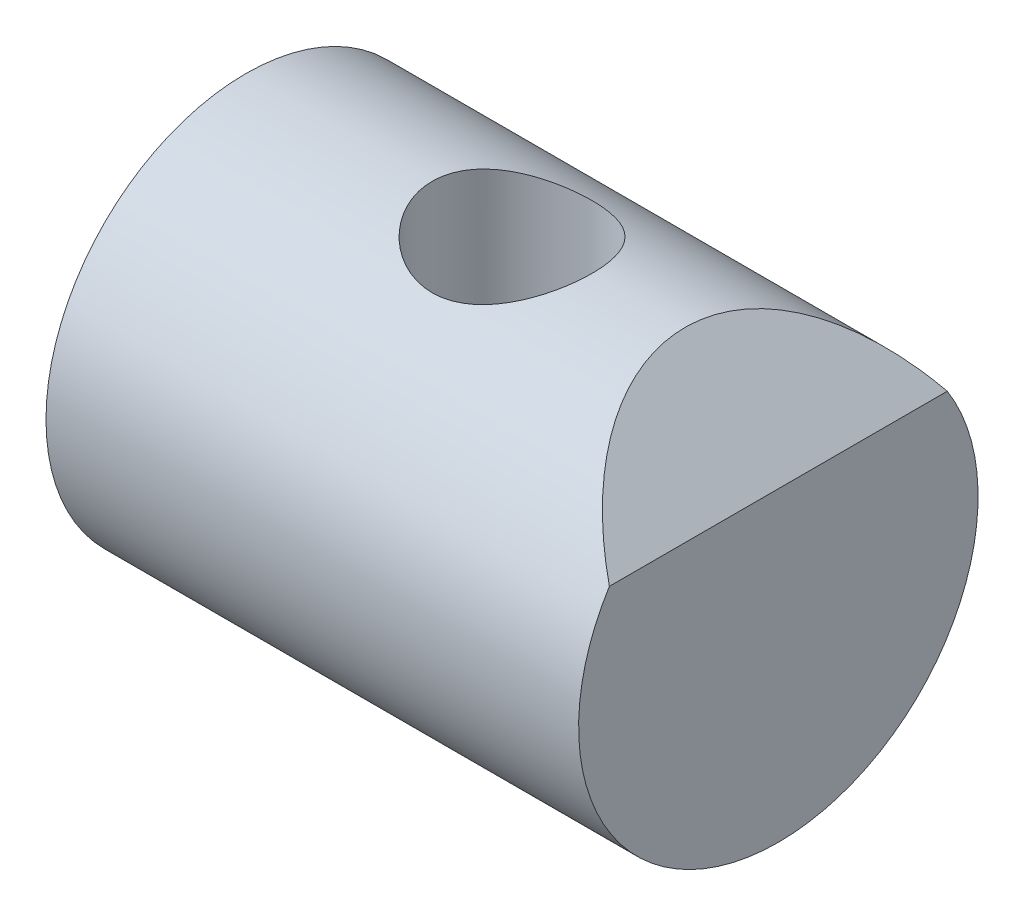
ISO-10303-21;
HEADER;
FILE_DESCRIPTION(('STEP AP214'),'2;1');
FILE_NAME('part.step','',(''),(''),'','','');
FILE_SCHEMA(('AUTOMOTIVE_DESIGN { 1 0 10303 214 1 1 1 1 }'));
ENDSEC;
DATA;
#1=APPLICATION_CONTEXT('core data for automotive mechanical design processes');
#2=APPLICATION_PROTOCOL_DEFINITION('international standard','automotive_design',2000,#1);
#3=PRODUCT_CONTEXT('',#1,'mechanical');
#4=PRODUCT('Part','Part','',(#3));
#5=PRODUCT_RELATED_PRODUCT_CATEGORY('part','',(#4));
#6=PRODUCT_DEFINITION_FORMATION('','',#4);
#7=PRODUCT_DEFINITION_CONTEXT('part definition',#1,'design');
#8=PRODUCT_DEFINITION('design','',#6,#7);
#9=PRODUCT_DEFINITION_SHAPE('','',#8);
#10=(LENGTH_UNIT() NAMED_UNIT(*) SI_UNIT(.MILLI.,.METRE.));
#11=(NAMED_UNIT(*) PLANE_ANGLE_UNIT() SI_UNIT($,.RADIAN.));
#12=(NAMED_UNIT(*) SI_UNIT($,.STERADIAN.) SOLID_ANGLE_UNIT());
#13=UNCERTAINTY_MEASURE_WITH_UNIT(LENGTH_MEASURE(1.E-05),#10,'distance_accuracy_value','');
#14=(GEOMETRIC_REPRESENTATION_CONTEXT(3) GLOBAL_UNCERTAINTY_ASSIGNED_CONTEXT((#13)) GLOBAL_UNIT_ASSIGNED_CONTEXT((#10,
#11,#12)) REPRESENTATION_CONTEXT('',''));
#15=CARTESIAN_POINT('',(0.,0.,0.));
#16=DIRECTION('',(0.,0.,1.));
#17=DIRECTION('',(1.,0.,0.));
#18=AXIS2_PLACEMENT_3D('',#15,#16,#17);
#19=CARTESIAN_POINT('',(0.,15.,15.));
#20=DIRECTION('',(0.,1.,0.));
#21=DIRECTION('',(0.,0.,1.));
#22=AXIS2_PLACEMENT_3D('',#19,#20,#21);
#23=CYLINDRICAL_SURFACE('',#22,5.99999999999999);
#24=CARTESIAN_POINT('',(0.,13.7477270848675,21.));
#25=CARTESIAN_POINT('',(-0.160765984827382,13.7477283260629,20.9999987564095));
#26=CARTESIAN_POINT('',(-0.321581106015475,13.7505565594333,20.9935297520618));
#27=CARTESIAN_POINT('',(-0.642048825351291,13.7617785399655,20.9677167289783));
#28=CARTESIAN_POINT('',(-0.80170065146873,13.7701756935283,20.9483648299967));
#29=CARTESIAN_POINT('',(-1.11890142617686,13.7922754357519,20.8969417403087));
#30=CARTESIAN_POINT('',(-1.27644553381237,13.8059885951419,20.864845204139));
#31=CARTESIAN_POINT('',(-1.58804060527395,13.8382744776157,20.7882539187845));
#32=CARTESIAN_POINT('',(-1.74209008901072,13.8568492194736,20.7437540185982));
#33=CARTESIAN_POINT('',(-2.04498326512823,13.8981849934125,20.6429959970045));
#34=CARTESIAN_POINT('',(-2.19384617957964,13.9209280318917,20.5867882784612));
#35=CARTESIAN_POINT('',(-2.48617450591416,13.969977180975,20.4629812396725));
#36=CARTESIAN_POINT('',(-2.62963783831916,13.9962846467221,20.3953775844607));
#37=CARTESIAN_POINT('',(-3.0504811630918,14.0794173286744,20.1763341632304));
#38=CARTESIAN_POINT('',(-3.3186931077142,14.1405074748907,20.0085349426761));
#39=CARTESIAN_POINT('',(-3.83785925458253,14.2710405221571,19.6239115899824));
#40=CARTESIAN_POINT('',(-4.08719705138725,14.340752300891,19.4049962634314));
#41=CARTESIAN_POINT('',(-4.43173906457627,14.4439708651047,19.0481020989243));
#42=CARTESIAN_POINT('',(-4.54173997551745,14.4781748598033,18.9242905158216));
#43=CARTESIAN_POINT('',(-4.75127893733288,14.5452673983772,18.6677974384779));
#44=CARTESIAN_POINT('',(-4.85082059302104,14.5781563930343,18.5351190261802));
#45=CARTESIAN_POINT('',(-5.04254160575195,14.6430448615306,18.2561569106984));
#46=CARTESIAN_POINT('',(-5.13426819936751,14.6749563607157,18.1095414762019));
#47=CARTESIAN_POINT('',(-5.3049385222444,14.7355355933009,17.8084787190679));
#48=CARTESIAN_POINT('',(-5.38388712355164,14.7642045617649,17.6540344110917));
#49=CARTESIAN_POINT('',(-5.52832744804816,14.8174861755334,17.3383170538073));
#50=CARTESIAN_POINT('',(-5.59382064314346,14.8420992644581,17.1770447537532));
#51=CARTESIAN_POINT('',(-5.71070630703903,14.8865456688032,16.8488303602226));
#52=CARTESIAN_POINT('',(-5.76209967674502,14.9063792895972,16.6818886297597));
#53=CARTESIAN_POINT('',(-5.84809570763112,14.9398371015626,16.3518276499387));
#54=CARTESIAN_POINT('',(-5.88339054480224,14.9537153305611,16.1889143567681));
#55=CARTESIAN_POINT('',(-5.94033370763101,14.9762104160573,15.8603647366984));
#56=CARTESIAN_POINT('',(-5.96198283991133,14.9848275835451,15.6947285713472));
#57=CARTESIAN_POINT('',(-5.99139107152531,14.9965524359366,15.3620836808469));
#58=CARTESIAN_POINT('',(-5.99915438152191,14.9996617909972,15.1950753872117));
#59=CARTESIAN_POINT('',(-6.00071466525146,15.0002858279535,14.8609858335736));
#60=CARTESIAN_POINT('',(-5.99451212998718,14.9978007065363,14.6939045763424));
#61=CARTESIAN_POINT('',(-5.96895714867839,14.9876056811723,14.3704186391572));
#62=CARTESIAN_POINT('',(-5.95036647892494,14.9801985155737,14.2139435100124));
#63=CARTESIAN_POINT('',(-5.90099471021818,14.9606558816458,13.9031762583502));
#64=CARTESIAN_POINT('',(-5.87020963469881,14.9485188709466,13.7488848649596));
#65=CARTESIAN_POINT('',(-5.79675476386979,14.9198265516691,13.4436355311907));
#66=CARTESIAN_POINT('',(-5.75408884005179,14.9032726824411,13.2926765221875));
#67=CARTESIAN_POINT('',(-5.6572347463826,14.8661462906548,12.9949530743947));
#68=CARTESIAN_POINT('',(-5.60304219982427,14.8455722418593,12.848190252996));
#69=CARTESIAN_POINT('',(-5.4827122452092,14.8005733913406,12.5576772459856));
#70=CARTESIAN_POINT('',(-5.41641137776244,14.7760965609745,12.4140027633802));
#71=CARTESIAN_POINT('',(-5.27292884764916,14.7241067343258,12.13274081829));
#72=CARTESIAN_POINT('',(-5.19574320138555,14.696592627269,11.9951556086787));
#73=CARTESIAN_POINT('',(-4.94868837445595,14.6104618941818,11.5927339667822));
#74=CARTESIAN_POINT('',(-4.76324187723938,14.5482260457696,11.3380409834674));
#75=CARTESIAN_POINT('',(-4.34199157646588,14.4156330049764,10.8456205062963));
#76=CARTESIAN_POINT('',(-4.10368095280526,14.3450108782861,10.6101047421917));
#77=CARTESIAN_POINT('',(-3.71919710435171,14.2413889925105,10.2887818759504));
#78=CARTESIAN_POINT('',(-3.5864329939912,14.2072110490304,10.1869408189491));
#79=CARTESIAN_POINT('',(-3.31258971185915,14.1405668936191,9.9945315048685));
#80=CARTESIAN_POINT('',(-3.17151362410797,14.1081000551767,9.90395910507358));
#81=CARTESIAN_POINT('',(-2.87766797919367,14.0449207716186,9.7322855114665));
#82=CARTESIAN_POINT('',(-2.72467878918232,14.0142856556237,9.65153169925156));
#83=CARTESIAN_POINT('',(-2.41176406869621,13.9568252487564,9.50333322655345));
#84=CARTESIAN_POINT('',(-2.25184138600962,13.9299984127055,9.43588316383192));
#85=CARTESIAN_POINT('',(-1.92615715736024,13.8810726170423,9.31492450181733));
#86=CARTESIAN_POINT('',(-1.76039747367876,13.8589721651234,9.26141150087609));
#87=CARTESIAN_POINT('',(-1.42425050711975,13.8202977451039,9.16888594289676));
#88=CARTESIAN_POINT('',(-1.25386359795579,13.803723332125,9.12987221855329));
#89=CARTESIAN_POINT('',(-0.920375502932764,13.7775602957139,9.06873811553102));
#90=CARTESIAN_POINT('',(-0.757465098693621,13.7676067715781,9.04573133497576));
#91=CARTESIAN_POINT('',(-0.4300594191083,13.7534799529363,9.01317216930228));
#92=CARTESIAN_POINT('',(-0.265564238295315,13.7493063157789,9.0036189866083));
#93=CARTESIAN_POINT('',(0.0636550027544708,13.7468891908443,8.9980797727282));
#94=CARTESIAN_POINT('',(0.228378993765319,13.7486441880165,9.00209027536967));
#95=CARTESIAN_POINT('',(0.556769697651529,13.7580178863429,9.02362304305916));
#96=CARTESIAN_POINT('',(0.720436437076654,13.7656364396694,9.04114496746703));
#97=CARTESIAN_POINT('',(1.03611506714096,13.7858678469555,9.08810886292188));
#98=CARTESIAN_POINT('',(1.18825783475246,13.7981698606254,9.11681110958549));
#99=CARTESIAN_POINT('',(1.48950121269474,13.8273689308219,9.18577009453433));
#100=CARTESIAN_POINT('',(1.6386008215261,13.8442674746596,9.22603057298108));
#101=CARTESIAN_POINT('',(1.9327492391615,13.8821556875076,9.3177283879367));
#102=CARTESIAN_POINT('',(2.07779883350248,13.9031445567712,9.36916353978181));
#103=CARTESIAN_POINT('',(2.36310025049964,13.9486342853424,9.48281352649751));
#104=CARTESIAN_POINT('',(2.50335020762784,13.9731364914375,9.54503249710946));
#105=CARTESIAN_POINT('',(2.78377896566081,14.0260368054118,9.68248854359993));
#106=CARTESIAN_POINT('',(2.92372851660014,14.054551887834,9.75814821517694));
#107=CARTESIAN_POINT('',(3.19686825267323,14.1139004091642,9.92011282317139));
#108=CARTESIAN_POINT('',(3.33005610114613,14.144734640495,10.006421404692));
#109=CARTESIAN_POINT('',(3.58896941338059,14.2079180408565,10.1891364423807));
#110=CARTESIAN_POINT('',(3.71469351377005,14.2402674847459,10.2855447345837));
#111=CARTESIAN_POINT('',(3.95802516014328,14.3056711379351,10.4878964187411));
#112=CARTESIAN_POINT('',(4.07563238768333,14.338725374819,10.5938401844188));
#113=CARTESIAN_POINT('',(4.31052910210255,14.4071898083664,10.8228951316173));
#114=CARTESIAN_POINT('',(4.42714853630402,14.442592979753,10.946696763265));
#115=CARTESIAN_POINT('',(4.64955892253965,14.5123136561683,11.2038840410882));
#116=CARTESIAN_POINT('',(4.75535329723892,14.5466315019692,11.3372666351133));
#117=CARTESIAN_POINT('',(4.95548564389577,14.6132792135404,11.612938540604));
#118=CARTESIAN_POINT('',(5.04981830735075,14.6456081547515,11.7552319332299));
#119=CARTESIAN_POINT('',(5.22621863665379,14.7073633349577,12.0477474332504));
#120=CARTESIAN_POINT('',(5.30829157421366,14.7367908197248,12.1979660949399));
#121=CARTESIAN_POINT('',(5.45954842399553,14.7919473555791,12.5054669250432));
#122=CARTESIAN_POINT('',(5.52872901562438,14.8176754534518,12.6627509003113));
#123=CARTESIAN_POINT('',(5.65349844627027,14.8646797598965,12.9831947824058));
#124=CARTESIAN_POINT('',(5.7090929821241,14.8859578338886,13.1463521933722));
#125=CARTESIAN_POINT('',(5.80614154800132,14.9234471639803,13.4773519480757));
#126=CARTESIAN_POINT('',(5.84759886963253,14.9396595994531,13.6451931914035));
#127=CARTESIAN_POINT('',(5.91592437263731,14.9665350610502,13.9842539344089));
#128=CARTESIAN_POINT('',(5.94279354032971,14.9771984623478,14.1554732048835));
#129=CARTESIAN_POINT('',(5.98036032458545,14.9921458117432,14.4886030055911));
#130=CARTESIAN_POINT('',(5.99199928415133,14.9968008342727,14.6503913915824));
#131=CARTESIAN_POINT('',(6.00213473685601,15.0008532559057,14.9744431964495));
#132=CARTESIAN_POINT('',(6.00063171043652,15.0002508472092,15.1367065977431));
#133=CARTESIAN_POINT('',(5.98450095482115,14.9938053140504,15.4604491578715));
#134=CARTESIAN_POINT('',(5.96987511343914,14.9879629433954,15.6219284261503));
#135=CARTESIAN_POINT('',(5.92765695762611,14.9711970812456,15.942913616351));
#136=CARTESIAN_POINT('',(5.90006469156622,14.9602736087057,16.1024195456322));
#137=CARTESIAN_POINT('',(5.8332499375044,14.9340514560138,16.4134009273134));
#138=CARTESIAN_POINT('',(5.79441412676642,14.9188987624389,16.5649720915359));
#139=CARTESIAN_POINT('',(5.70517316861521,14.8844652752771,16.8642394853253));
#140=CARTESIAN_POINT('',(5.65476421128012,14.8651831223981,17.0119344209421));
#141=CARTESIAN_POINT('',(5.54282380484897,14.8229622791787,17.302462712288));
#142=CARTESIAN_POINT('',(5.48129486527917,14.8000244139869,17.4452971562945));
#143=CARTESIAN_POINT('',(5.34756028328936,14.7510179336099,17.7253794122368));
#144=CARTESIAN_POINT('',(5.27535058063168,14.7249481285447,17.8626250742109));
#145=CARTESIAN_POINT('',(5.11739005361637,14.6690826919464,18.1366238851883));
#146=CARTESIAN_POINT('',(5.03118444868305,14.6391738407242,18.273091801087));
#147=CARTESIAN_POINT('',(4.84828048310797,14.5773253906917,18.5383818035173));
#148=CARTESIAN_POINT('',(4.75157849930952,14.5453850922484,18.667201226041));
#149=CARTESIAN_POINT('',(4.54829113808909,14.480251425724,18.9164934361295));
#150=CARTESIAN_POINT('',(4.4417038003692,14.447057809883,19.0369645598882));
#151=CARTESIAN_POINT('',(4.21927329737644,14.3802300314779,19.2689053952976));
#152=CARTESIAN_POINT('',(4.10342984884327,14.3465958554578,19.3803748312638));
#153=CARTESIAN_POINT('',(3.85563068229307,14.2776350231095,19.6003520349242));
#154=CARTESIAN_POINT('',(3.723120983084,14.2423331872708,19.7082445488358));
#155=CARTESIAN_POINT('',(3.44918385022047,14.1731899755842,19.9124645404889));
#156=CARTESIAN_POINT('',(3.30775944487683,14.1393481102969,20.0087959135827));
#157=CARTESIAN_POINT('',(3.01669573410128,14.0741014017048,20.1893052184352));
#158=CARTESIAN_POINT('',(2.86705162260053,14.0426980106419,20.2734759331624));
#159=CARTESIAN_POINT('',(2.5606133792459,13.9833532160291,20.4288814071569));
#160=CARTESIAN_POINT('',(2.40382277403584,13.9554101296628,20.5001224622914));
#161=CARTESIAN_POINT('',(2.09838301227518,13.9062060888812,20.6232933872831));
#162=CARTESIAN_POINT('',(1.95026004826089,13.8845710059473,20.6763805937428));
#163=CARTESIAN_POINT('',(1.64984361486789,13.8455704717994,20.770857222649));
#164=CARTESIAN_POINT('',(1.49755207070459,13.8282030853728,20.8122519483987));
#165=CARTESIAN_POINT('',(1.19007642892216,13.7982941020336,20.8829031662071));
#166=CARTESIAN_POINT('',(1.03489954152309,13.7857418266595,20.9121865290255));
#167=CARTESIAN_POINT('',(0.722455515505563,13.7658152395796,20.9584370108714));
#168=CARTESIAN_POINT('',(0.565189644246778,13.7584379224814,20.9754112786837));
#169=CARTESIAN_POINT('',(0.339674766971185,13.751755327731,20.9907631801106));
#170=CARTESIAN_POINT('',(0.271800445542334,13.7502459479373,20.9942257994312));
#171=CARTESIAN_POINT('',(0.135953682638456,13.7482315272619,20.9988445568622));
#172=CARTESIAN_POINT('',(0.0679812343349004,13.7477265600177,21.0000005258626));
#173=CARTESIAN_POINT('',(0.,13.7477270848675,21.));
#174=B_SPLINE_CURVE_WITH_KNOTS('',3,(#24,#25,#26,#27,#28,#29,#30,#31,#32,#33,#34,#35,#36,#37,
#38,#39,#40,#41,#42,#43,#44,#45,#46,#47,#48,#49,#50,#51,#52,#53,#54,#55,#56,#57,#58,#59,#60,#61,
#62,#63,#64,#65,#66,#67,#68,#69,#70,#71,#72,#73,#74,#75,#76,#77,#78,#79,#80,#81,#82,#83,#84,#85,
#86,#87,#88,#89,#90,#91,#92,#93,#94,#95,#96,#97,#98,#99,#100,#101,#102,#103,#104,#105,#106,#107,
#108,#109,#110,#111,#112,#113,#114,#115,#116,#117,#118,#119,#120,#121,#122,#123,#124,#125,#126,
#127,#128,#129,#130,#131,#132,#133,#134,#135,#136,#137,#138,#139,#140,#141,#142,#143,#144,#145,
#146,#147,#148,#149,#150,#151,#152,#153,#154,#155,#156,#157,#158,#159,#160,#161,#162,#163,#164,
#165,#166,#167,#168,#169,#170,#171,#172,#173),.UNSPECIFIED.,.T.,.F.,(4,2,2,2,2,2,2,2,2,2,2,2,2,
2,2,2,2,2,2,2,2,2,2,2,2,2,2,2,2,2,2,2,2,2,2,2,2,2,2,2,2,2,2,2,2,2,2,2,2,2,2,2,2,2,2,2,2,2,2,2,2,
2,2,2,2,2,2,2,2,2,2,2,2,2,4),(0.,0.482229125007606,0.964753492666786,1.44824230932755,
1.93193221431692,2.41358131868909,2.89541405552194,3.85788445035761,4.87027013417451,
5.37714851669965,5.88385162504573,6.41078994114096,6.93752686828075,7.4642061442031,
7.99085176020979,8.49201228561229,8.9931431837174,9.49412209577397,9.9950833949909,
10.4677763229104,10.9406235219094,11.4133168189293,11.8861899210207,12.3659950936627,
12.8459763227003,13.8053197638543,14.827648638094,15.3395121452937,15.8511869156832,
16.3775800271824,16.9037589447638,17.429771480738,17.9557416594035,18.4495809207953,
18.9433909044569,19.4370747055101,19.9307460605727,20.3961592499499,20.8617232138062,
21.3271962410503,21.7928481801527,22.2772086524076,22.7617353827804,23.2463503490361,
23.7309843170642,24.2515501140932,24.7719508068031,25.2925916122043,25.8130078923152,
26.3335580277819,26.8538895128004,27.3740997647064,27.8942748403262,28.3804860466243,
28.8666794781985,29.3528029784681,29.8389246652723,30.309990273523,30.7812111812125,
31.2523258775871,31.7236201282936,32.2155707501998,32.7076917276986,33.1999105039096,
33.6921443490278,34.2149887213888,34.7376564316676,35.2606330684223,35.7833543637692,
36.2593204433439,36.7350702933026,37.2097588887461,37.684171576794,37.8880712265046,
38.0919858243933),.UNSPECIFIED.);
#175=CARTESIAN_POINT('',(0.,13.7477270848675,21.));
#176=VERTEX_POINT('',#175);
#177=EDGE_CURVE('E44',#176,#176,#174,.T.);
#178=ORIENTED_EDGE('',*,*,#177,.F.);
#179=EDGE_LOOP('',(#178));
#180=FACE_BOUND('',#179,.T.);
#181=CARTESIAN_POINT('',(-5.99999999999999,-15.,15.));
#182=CARTESIAN_POINT('',(-5.99999907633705,-14.9999992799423,15.1613136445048));
#183=CARTESIAN_POINT('',(-5.99348550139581,-14.9973905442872,15.3226895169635));
#184=CARTESIAN_POINT('',(-5.96748987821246,-14.9870209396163,15.6442996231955));
#185=CARTESIAN_POINT('',(-5.9479991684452,-14.9792566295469,15.8045330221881));
#186=CARTESIAN_POINT('',(-5.89618961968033,-14.9587594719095,16.1229503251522));
#187=CARTESIAN_POINT('',(-5.863843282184,-14.9460159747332,16.2811290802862));
#188=CARTESIAN_POINT('',(-5.78663177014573,-14.9158923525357,16.5940111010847));
#189=CARTESIAN_POINT('',(-5.74176147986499,-14.8985103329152,16.7487129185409));
#190=CARTESIAN_POINT('',(-5.64011880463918,-14.85963474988,17.0529711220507));
#191=CARTESIAN_POINT('',(-5.58339119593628,-14.8381566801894,17.2025444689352));
#192=CARTESIAN_POINT('',(-5.4584017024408,-14.7915782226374,17.4962649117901));
#193=CARTESIAN_POINT('',(-5.39013550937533,-14.7664764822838,17.6404099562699));
#194=CARTESIAN_POINT('',(-5.24266819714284,-14.7132880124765,17.9222769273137));
#195=CARTESIAN_POINT('',(-5.16347555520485,-14.6852036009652,18.0600037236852));
#196=CARTESIAN_POINT('',(-4.99467518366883,-14.6267056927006,18.3284212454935));
#197=CARTESIAN_POINT('',(-4.90506368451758,-14.5962913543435,18.4591093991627));
#198=CARTESIAN_POINT('',(-4.61340096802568,-14.4999578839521,18.8503463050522));
#199=CARTESIAN_POINT('',(-4.39475150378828,-14.4312855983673,19.0981207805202));
#200=CARTESIAN_POINT('',(-3.91972848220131,-14.2938006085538,19.5545910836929));
#201=CARTESIAN_POINT('',(-3.66333657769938,-14.2249878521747,19.7632677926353));
#202=CARTESIAN_POINT('',(-3.24887569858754,-14.1257237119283,20.047237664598));
#203=CARTESIAN_POINT('',(-3.1022648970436,-14.0926348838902,20.1386650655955));
#204=CARTESIAN_POINT('',(-2.8012358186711,-14.0294439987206,20.3087594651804));
#205=CARTESIAN_POINT('',(-2.64682078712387,-13.9993407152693,20.3874317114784));
#206=CARTESIAN_POINT('',(-2.33114969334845,-13.9431035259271,20.5313507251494));
#207=CARTESIAN_POINT('',(-2.1698931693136,-13.9169698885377,20.596596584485));
#208=CARTESIAN_POINT('',(-1.84174929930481,-13.8695965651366,20.7129889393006));
#209=CARTESIAN_POINT('',(-1.67486482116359,-13.8483544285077,20.7641424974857));
#210=CARTESIAN_POINT('',(-1.34428057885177,-13.812361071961,20.8498500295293));
#211=CARTESIAN_POINT('',(-1.18077440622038,-13.7973611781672,20.8850463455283));
#212=CARTESIAN_POINT('',(-0.851047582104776,-13.7730632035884,20.9416902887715));
#213=CARTESIAN_POINT('',(-0.684828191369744,-13.763762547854,20.9631441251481));
#214=CARTESIAN_POINT('',(-0.350984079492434,-13.7511953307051,20.9920678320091));
#215=CARTESIAN_POINT('',(-0.183359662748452,-13.7479274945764,20.9995406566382));
#216=CARTESIAN_POINT('',(0.151929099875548,-13.7475446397,21.0004181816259));
#217=CARTESIAN_POINT('',(0.319593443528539,-13.7504293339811,20.9938235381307));
#218=CARTESIAN_POINT('',(0.641884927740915,-13.7618280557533,20.9676017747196));
#219=CARTESIAN_POINT('',(0.796604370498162,-13.7699346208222,20.948917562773));
#220=CARTESIAN_POINT('',(1.103840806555,-13.7911192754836,20.8996396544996));
#221=CARTESIAN_POINT('',(1.25635705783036,-13.8041990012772,20.8690420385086));
#222=CARTESIAN_POINT('',(1.55807979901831,-13.8349228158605,20.7962460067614));
#223=CARTESIAN_POINT('',(1.7072870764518,-13.8525658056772,20.7540503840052));
#224=CARTESIAN_POINT('',(2.00156268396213,-13.8919033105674,20.6584179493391));
#225=CARTESIAN_POINT('',(2.14662939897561,-13.9135993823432,20.6049768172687));
#226=CARTESIAN_POINT('',(2.43458921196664,-13.9608971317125,20.4861207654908));
#227=CARTESIAN_POINT('',(2.57738076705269,-13.9865682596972,20.4204876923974));
#228=CARTESIAN_POINT('',(2.85699543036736,-14.0407834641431,20.2784634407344));
#229=CARTESIAN_POINT('',(2.99381649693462,-14.0693285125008,20.2020686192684));
#230=CARTESIAN_POINT('',(3.26075619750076,-14.1285380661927,20.0390407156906));
#231=CARTESIAN_POINT('',(3.39087393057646,-14.1592028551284,19.9524062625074));
#232=CARTESIAN_POINT('',(3.64375143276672,-14.2218815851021,19.7694272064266));
#233=CARTESIAN_POINT('',(3.76651082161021,-14.2538955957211,19.6730821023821));
#234=CARTESIAN_POINT('',(4.01328743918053,-14.321009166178,19.4633769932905));
#235=CARTESIAN_POINT('',(4.13666401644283,-14.3561554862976,19.3492769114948));
#236=CARTESIAN_POINT('',(4.37341997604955,-14.4261573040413,19.1111291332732));
#237=CARTESIAN_POINT('',(4.48680229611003,-14.46101288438,18.9870843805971));
#238=CARTESIAN_POINT('',(4.7029765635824,-14.5295379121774,18.7296483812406));
#239=CARTESIAN_POINT('',(4.80576237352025,-14.563206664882,18.596251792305));
#240=CARTESIAN_POINT('',(4.99993388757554,-14.6284304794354,18.3209962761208));
#241=CARTESIAN_POINT('',(5.09132414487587,-14.6599863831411,18.1791407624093));
#242=CARTESIAN_POINT('',(5.26379970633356,-14.7207656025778,17.8848036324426));
#243=CARTESIAN_POINT('',(5.34463859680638,-14.7499286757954,17.7321649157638));
#244=CARTESIAN_POINT('',(5.49305024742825,-14.8043518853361,17.4199706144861));
#245=CARTESIAN_POINT('',(5.56062834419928,-14.8296135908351,17.2604178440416));
#246=CARTESIAN_POINT('',(5.68189175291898,-14.875508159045,16.9355018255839));
#247=CARTESIAN_POINT('',(5.73557981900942,-14.8961419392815,16.7701397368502));
#248=CARTESIAN_POINT('',(5.82850487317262,-14.9321676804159,16.4348478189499));
#249=CARTESIAN_POINT('',(5.86774286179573,-14.9475600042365,16.2649183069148));
#250=CARTESIAN_POINT('',(5.92943749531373,-14.9718895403,15.9320436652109));
#251=CARTESIAN_POINT('',(5.95275025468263,-14.9811550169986,15.7692807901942));
#252=CARTESIAN_POINT('',(5.98594164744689,-14.9943744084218,15.4421793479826));
#253=CARTESIAN_POINT('',(5.99582094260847,-14.9983285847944,15.2778408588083));
#254=CARTESIAN_POINT('',(6.0020366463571,-15.000814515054,14.9489040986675));
#255=CARTESIAN_POINT('',(5.99837604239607,-14.9993474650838,14.7843058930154));
#256=CARTESIAN_POINT('',(5.97755913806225,-14.9910347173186,14.4561043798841));
#257=CARTESIAN_POINT('',(5.96040309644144,-14.9841891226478,14.2925010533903));
#258=CARTESIAN_POINT('',(5.91386131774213,-14.9657383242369,13.9748999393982));
#259=CARTESIAN_POINT('',(5.88506327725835,-14.9543621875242,13.8208021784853));
#260=CARTESIAN_POINT('',(5.81560059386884,-14.9271627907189,13.5156541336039));
#261=CARTESIAN_POINT('',(5.77493206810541,-14.9113380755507,13.3646048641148));
#262=CARTESIAN_POINT('',(5.68211166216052,-14.8756364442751,13.0666209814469));
#263=CARTESIAN_POINT('',(5.62996296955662,-14.8557606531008,12.919685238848));
#264=CARTESIAN_POINT('',(5.51459039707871,-14.8124221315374,12.6307158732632));
#265=CARTESIAN_POINT('',(5.4513623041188,-14.788958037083,12.4886841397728));
#266=CARTESIAN_POINT('',(5.31225631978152,-14.738240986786,12.2061734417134));
#267=CARTESIAN_POINT('',(5.23605401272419,-14.7108949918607,12.0658709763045));
#268=CARTESIAN_POINT('',(5.07295579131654,-14.653636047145,11.7921165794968));
#269=CARTESIAN_POINT('',(4.9860562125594,-14.6237222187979,11.658667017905));
#270=CARTESIAN_POINT('',(4.80214466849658,-14.5620427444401,11.3993503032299));
#271=CARTESIAN_POINT('',(4.7051309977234,-14.5302767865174,11.2734844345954));
#272=CARTESIAN_POINT('',(4.50158537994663,-14.4656475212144,11.0299985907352));
#273=CARTESIAN_POINT('',(4.39505301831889,-14.4327841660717,10.9123789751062));
#274=CARTESIAN_POINT('',(4.16569829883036,-14.3645492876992,10.6784803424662));
#275=CARTESIAN_POINT('',(4.04226426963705,-14.3291558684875,10.5628066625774));
#276=CARTESIAN_POINT('',(3.78601523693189,-14.2589878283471,10.3422474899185));
#277=CARTESIAN_POINT('',(3.65320316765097,-14.2242130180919,10.2373586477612));
#278=CARTESIAN_POINT('',(3.37884276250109,-14.1562321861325,10.0389419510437));
#279=CARTESIAN_POINT('',(3.2372894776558,-14.1230270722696,9.94542062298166));
#280=CARTESIAN_POINT('',(2.94639783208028,-14.0592011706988,9.77051348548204));
#281=CARTESIAN_POINT('',(2.79706277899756,-14.0285792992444,9.68912257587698));
#282=CARTESIAN_POINT('',(2.48989739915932,-13.9705625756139,9.53831714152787));
#283=CARTESIAN_POINT('',(2.33199586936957,-13.9432038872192,9.46903346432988));
#284=CARTESIAN_POINT('',(2.0102459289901,-13.8930146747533,9.34414678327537));
#285=CARTESIAN_POINT('',(1.84640009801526,-13.8701822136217,9.28853792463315));
#286=CARTESIAN_POINT('',(1.51396706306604,-13.8298551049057,9.19156917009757));
#287=CARTESIAN_POINT('',(1.34538176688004,-13.8123583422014,9.15020362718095));
#288=CARTESIAN_POINT('',(1.0047656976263,-13.7833513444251,9.08217949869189));
#289=CARTESIAN_POINT('',(0.832735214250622,-13.7718406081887,9.05551968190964));
#290=CARTESIAN_POINT('',(0.499171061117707,-13.755851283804,9.01861841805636));
#291=CARTESIAN_POINT('',(0.33777353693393,-13.7509260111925,9.00733295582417));
#292=CARTESIAN_POINT('',(0.0145233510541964,-13.7467850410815,8.99783953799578));
#293=CARTESIAN_POINT('',(-0.147329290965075,-13.7475691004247,8.99963102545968));
#294=CARTESIAN_POINT('',(-0.470211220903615,-13.7548190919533,9.01626935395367));
#295=CARTESIAN_POINT('',(-0.631240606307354,-13.7612843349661,9.03111461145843));
#296=CARTESIAN_POINT('',(-0.951267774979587,-13.7796730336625,9.07369025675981));
#297=CARTESIAN_POINT('',(-1.11026556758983,-13.7915964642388,9.10142058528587));
#298=CARTESIAN_POINT('',(-1.41879511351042,-13.8199248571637,9.16811084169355));
#299=CARTESIAN_POINT('',(-1.56845168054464,-13.8361324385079,9.20657958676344));
#300=CARTESIAN_POINT('',(-1.86393032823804,-13.872733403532,9.29477902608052));
#301=CARTESIAN_POINT('',(-2.00975114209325,-13.8931281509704,9.34451339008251));
#302=CARTESIAN_POINT('',(-2.296647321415,-13.9375216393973,9.45482001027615));
#303=CARTESIAN_POINT('',(-2.43772331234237,-13.9615199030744,9.51539083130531));
#304=CARTESIAN_POINT('',(-2.71441172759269,-14.0124768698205,9.64692009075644));
#305=CARTESIAN_POINT('',(-2.85002214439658,-14.0394366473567,9.71788230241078));
#306=CARTESIAN_POINT('',(-3.26266441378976,-14.1269314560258,9.95429843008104));
#307=CARTESIAN_POINT('',(-3.52918514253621,-14.1914514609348,10.1370462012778));
#308=CARTESIAN_POINT('',(-4.02905084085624,-14.3239291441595,10.5423814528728));
#309=CARTESIAN_POINT('',(-4.26238577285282,-14.3918878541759,10.7649809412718));
#310=CARTESIAN_POINT('',(-4.59061111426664,-14.4935144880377,11.1327399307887));
#311=CARTESIAN_POINT('',(-4.69926699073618,-14.5283750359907,11.2655168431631));
#312=CARTESIAN_POINT('',(-4.90500130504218,-14.596218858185,11.540177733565));
#313=CARTESIAN_POINT('',(-5.00208398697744,-14.6292028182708,11.6820583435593));
#314=CARTESIAN_POINT('',(-5.1840400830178,-14.692412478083,11.9742143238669));
#315=CARTESIAN_POINT('',(-5.26890193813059,-14.7226355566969,12.1244974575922));
#316=CARTESIAN_POINT('',(-5.42556550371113,-14.7794259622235,12.4323080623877));
#317=CARTESIAN_POINT('',(-5.49737318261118,-14.8059949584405,12.5898321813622));
#318=CARTESIAN_POINT('',(-5.62611984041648,-14.8542831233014,12.908177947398));
#319=CARTESIAN_POINT('',(-5.68330479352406,-14.8760814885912,13.0688880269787));
#320=CARTESIAN_POINT('',(-5.78388280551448,-14.9147961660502,13.3950677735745));
#321=CARTESIAN_POINT('',(-5.8272823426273,-14.9317147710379,13.5605351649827));
#322=CARTESIAN_POINT('',(-5.89976280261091,-14.9601501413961,13.8945852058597));
#323=CARTESIAN_POINT('',(-5.92887968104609,-14.9716804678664,14.0631589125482));
#324=CARTESIAN_POINT('',(-5.9726090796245,-14.9890510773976,14.4023817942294));
#325=CARTESIAN_POINT('',(-5.98723258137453,-14.9948956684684,14.5730292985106));
#326=CARTESIAN_POINT('',(-5.99635639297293,-14.9985429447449,14.7866095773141));
#327=CARTESIAN_POINT('',(-5.99772244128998,-14.9990891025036,14.8292731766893));
#328=CARTESIAN_POINT('',(-5.99954436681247,-14.9998177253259,14.9146230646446));
#329=CARTESIAN_POINT('',(-6.00000024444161,-15.0000001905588,14.9573093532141));
#330=CARTESIAN_POINT('',(-5.99999999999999,-15.,15.));
#331=B_SPLINE_CURVE_WITH_KNOTS('',3,(#181,#182,#183,#184,#185,#186,#187,#188,#189,#190,#191,
#192,#193,#194,#195,#196,#197,#198,#199,#200,#201,#202,#203,#204,#205,#206,#207,#208,#209,#210,
#211,#212,#213,#214,#215,#216,#217,#218,#219,#220,#221,#222,#223,#224,#225,#226,#227,#228,#229,
#230,#231,#232,#233,#234,#235,#236,#237,#238,#239,#240,#241,#242,#243,#244,#245,#246,#247,#248,
#249,#250,#251,#252,#253,#254,#255,#256,#257,#258,#259,#260,#261,#262,#263,#264,#265,#266,#267,
#268,#269,#270,#271,#272,#273,#274,#275,#276,#277,#278,#279,#280,#281,#282,#283,#284,#285,#286,
#287,#288,#289,#290,#291,#292,#293,#294,#295,#296,#297,#298,#299,#300,#301,#302,#303,#304,#305,
#306,#307,#308,#309,#310,#311,#312,#313,#314,#315,#316,#317,#318,#319,#320,#321,#322,#323,#324,
#325,#326,#327,#328,#329,#330),.UNSPECIFIED.,.T.,.F.,(4,2,2,2,2,2,2,2,2,2,2,2,2,2,2,2,2,2,2,2,2,
2,2,2,2,2,2,2,2,2,2,2,2,2,2,2,2,2,2,2,2,2,2,2,2,2,2,2,2,2,2,2,2,2,2,2,2,2,2,2,2,2,2,2,2,2,2,2,2,
2,2,2,2,2,4),(0.,0.483897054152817,0.968117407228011,1.45337914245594,1.9388393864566,
2.42249849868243,2.90633859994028,3.38980540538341,3.87344767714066,4.88128652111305,
5.88961691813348,6.41682474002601,6.94381510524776,7.47084109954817,7.99760247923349,
8.50070582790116,9.00358170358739,9.50635131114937,10.0090974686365,10.4767118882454,
10.9444802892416,11.4121361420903,11.8799719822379,12.3571671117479,12.8345241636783,
13.3119452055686,13.7893908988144,14.3038604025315,14.8181781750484,15.3327921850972,
15.8471999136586,16.3720340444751,16.8966565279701,17.4211749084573,17.945656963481,
18.4390821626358,18.932483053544,19.4257750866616,19.9190576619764,20.3900487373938,
20.8611940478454,21.3322087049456,21.8034028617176,22.2888301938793,22.7744242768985,
23.2601003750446,23.7457976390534,24.2636804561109,24.7814019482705,25.299419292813,
25.8172182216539,26.3403070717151,26.8631715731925,27.3858285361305,27.9084417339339,
28.3934227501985,28.8783831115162,29.3632846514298,29.8481839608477,30.3137727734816,
30.7795134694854,31.2451925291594,31.7110411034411,32.695156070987,33.679568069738,
34.2042554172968,34.7287497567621,35.2537369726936,35.778483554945,36.293716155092,
36.8087062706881,37.3223931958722,37.8356906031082,37.9637509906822,38.0918113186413),.UNSPECIFIED.);
#332=CARTESIAN_POINT('',(-5.99999999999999,-15.,15.));
#333=VERTEX_POINT('',#332);
#334=EDGE_CURVE('E11',#333,#333,#331,.T.);
#335=ORIENTED_EDGE('',*,*,#334,.F.);
#336=EDGE_LOOP('',(#335));
#337=FACE_BOUND('',#336,.T.);
#338=ADVANCED_FACE('F32',(#180,#337),#23,.F.);
#339=CARTESIAN_POINT('',(20.,0.,15.));
#340=DIRECTION('',(-1.,0.,0.));
#341=DIRECTION('',(0.,-1.,0.));
#342=AXIS2_PLACEMENT_3D('',#339,#340,#341);
#343=CYLINDRICAL_SURFACE('',#342,15.);
#344=ORIENTED_EDGE('',*,*,#177,.T.);
#345=EDGE_LOOP('',(#344));
#346=FACE_BOUND('',#345,.T.);
#347=CARTESIAN_POINT('',(-20.,0.,15.));
#348=DIRECTION('',(-1.,0.,0.));
#349=DIRECTION('',(0.,-1.,0.));
#350=AXIS2_PLACEMENT_3D('',#347,#348,#349);
#351=CIRCLE('',#350,15.);
#352=CARTESIAN_POINT('',(-20.,-15.,15.));
#353=VERTEX_POINT('',#352);
#354=EDGE_CURVE('E58',#353,#353,#351,.T.);
#355=ORIENTED_EDGE('',*,*,#354,.F.);
#356=EDGE_LOOP('',(#355));
#357=FACE_BOUND('',#356,.T.);
#358=ORIENTED_EDGE('',*,*,#334,.T.);
#359=EDGE_LOOP('',(#358));
#360=FACE_BOUND('',#359,.T.);
#361=CARTESIAN_POINT('',(28.,0.,15.));
#362=DIRECTION('',(-0.707106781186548,-0.707106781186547,0.));
#363=DIRECTION('',(-0.707106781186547,0.707106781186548,0.));
#364=AXIS2_PLACEMENT_3D('',#361,#362,#363);
#365=ELLIPSE('',#364,21.2132034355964,15.);
#366=CARTESIAN_POINT('',(20.,8.,27.6885775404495));
#367=VERTEX_POINT('',#366);
#368=CARTESIAN_POINT('',(20.,8.,2.31142245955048));
#369=VERTEX_POINT('',#368);
#370=EDGE_CURVE('E57',#367,#369,#365,.T.);
#371=ORIENTED_EDGE('',*,*,#370,.T.);
#372=CARTESIAN_POINT('',(20.,0.,15.));
#373=DIRECTION('',(-1.,0.,0.));
#374=DIRECTION('',(0.,-1.,0.));
#375=AXIS2_PLACEMENT_3D('',#372,#373,#374);
#376=CIRCLE('',#375,15.);
#377=EDGE_CURVE('E50',#369,#367,#376,.T.);
#378=ORIENTED_EDGE('',*,*,#377,.T.);
#379=EDGE_LOOP('',(#371,#378));
#380=FACE_BOUND('',#379,.T.);
#381=ADVANCED_FACE('F60',(#346,#357,#360,#380),#343,.T.);
#382=CARTESIAN_POINT('',(13.,15.,0.));
#383=DIRECTION('',(-0.707106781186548,-0.707106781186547,0.));
#384=DIRECTION('',(0.707106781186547,-0.707106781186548,0.));
#385=AXIS2_PLACEMENT_3D('',#382,#383,#384);
#386=PLANE('',#385);
#387=DIRECTION('',(0.,0.,1.));
#388=VECTOR('',#387,1.);
#389=CARTESIAN_POINT('',(20.,8.,0.));
#390=LINE('',#389,#388);
#391=EDGE_CURVE('E56',#369,#367,#390,.T.);
#392=ORIENTED_EDGE('',*,*,#391,.F.);
#393=ORIENTED_EDGE('',*,*,#370,.F.);
#394=EDGE_LOOP('',(#392,#393));
#395=FACE_BOUND('',#394,.T.);
#396=ADVANCED_FACE('F63',(#395),#386,.F.);
#397=CARTESIAN_POINT('',(20.,15.,30.));
#398=DIRECTION('',(-1.,0.,0.));
#399=DIRECTION('',(0.,0.,1.));
#400=AXIS2_PLACEMENT_3D('',#397,#398,#399);
#401=PLANE('',#400);
#402=ORIENTED_EDGE('',*,*,#377,.F.);
#403=ORIENTED_EDGE('',*,*,#391,.T.);
#404=EDGE_LOOP('',(#402,#403));
#405=FACE_BOUND('',#404,.T.);
#406=ADVANCED_FACE('F54',(#405),#401,.F.);
#407=CARTESIAN_POINT('',(-20.,15.,30.));
#408=DIRECTION('',(1.,0.,0.));
#409=DIRECTION('',(0.,1.,0.));
#410=AXIS2_PLACEMENT_3D('',#407,#408,#409);
#411=PLANE('',#410);
#412=ORIENTED_EDGE('',*,*,#354,.T.);
#413=EDGE_LOOP('',(#412));
#414=FACE_BOUND('',#413,.T.);
#415=ADVANCED_FACE('F34',(#414),#411,.F.);
#416=CLOSED_SHELL('',(#338,#381,#396,#406,#415));
#417=MANIFOLD_SOLID_BREP('B2',#416);
#418=ADVANCED_BREP_SHAPE_REPRESENTATION('',(#18,#417),#14);
#419=SHAPE_DEFINITION_REPRESENTATION(#9,#418);
ENDSEC;
END-ISO-10303-21;
